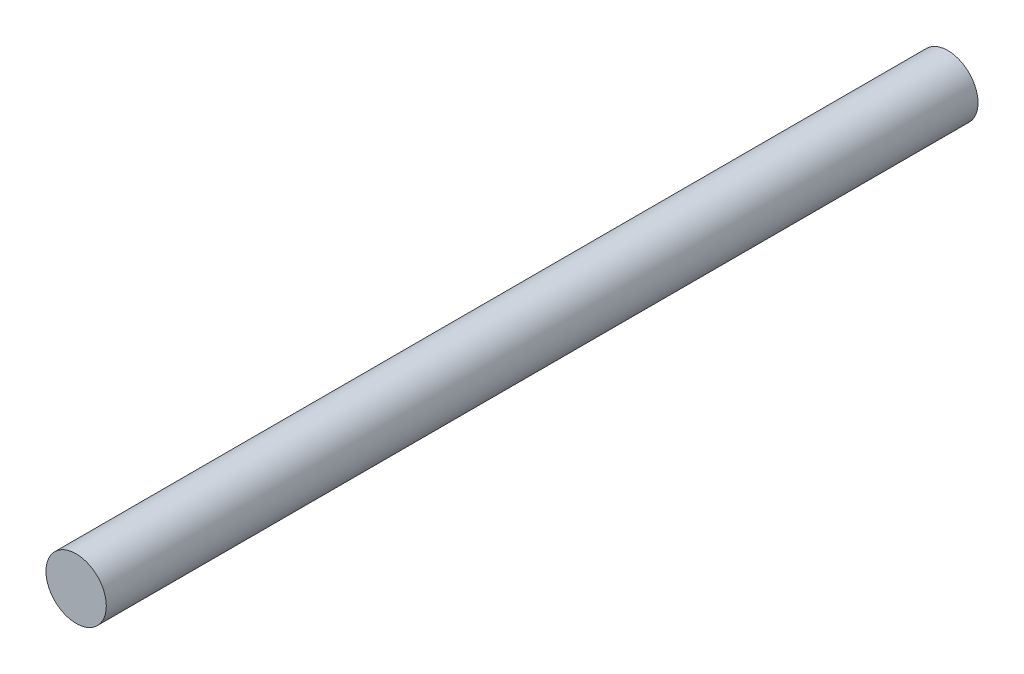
from build123d import *

# Parameters (mm, degrees)
SKETCH_1_R      = 1.35
EXTRUDE_1_DEPTH = 39


with BuildPart() as part:
    # Sketch 1 → Extrude 1 (new body)
    with BuildSketch(Plane.XY):
        Circle(SKETCH_1_R)
    extrude(amount=EXTRUDE_1_DEPTH)


solid = part.part
